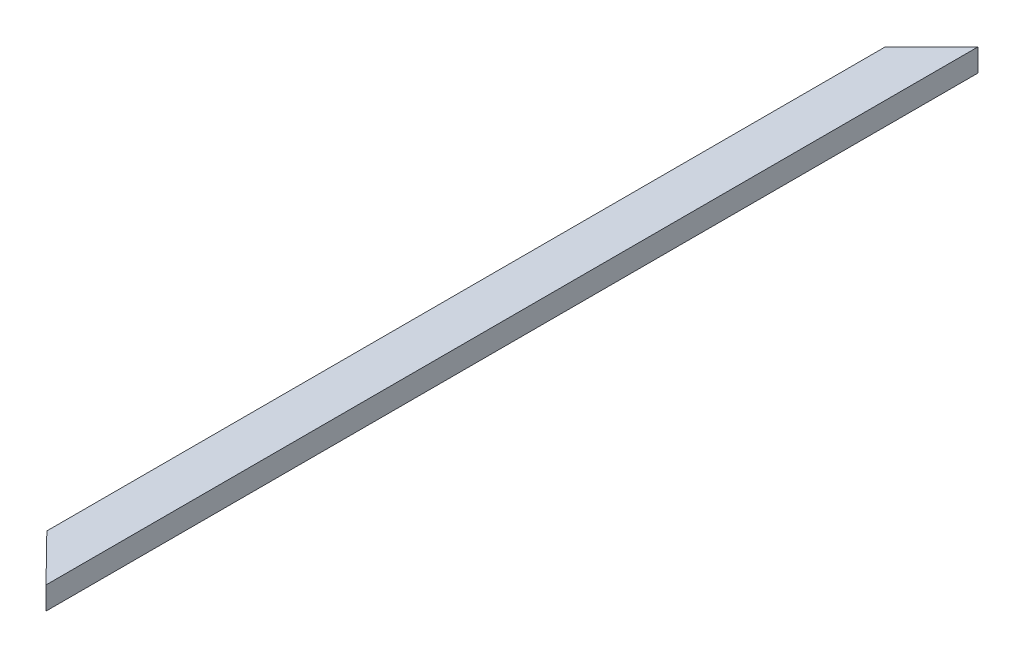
ISO-10303-21;
HEADER;
FILE_DESCRIPTION(('STEP AP214'),'2;1');
FILE_NAME('part.step','',(''),(''),'','','');
FILE_SCHEMA(('AUTOMOTIVE_DESIGN { 1 0 10303 214 1 1 1 1 }'));
ENDSEC;
DATA;
#1=APPLICATION_CONTEXT('core data for automotive mechanical design processes');
#2=APPLICATION_PROTOCOL_DEFINITION('international standard','automotive_design',2000,#1);
#3=PRODUCT_CONTEXT('',#1,'mechanical');
#4=PRODUCT('Part','Part','',(#3));
#5=PRODUCT_RELATED_PRODUCT_CATEGORY('part','',(#4));
#6=PRODUCT_DEFINITION_FORMATION('','',#4);
#7=PRODUCT_DEFINITION_CONTEXT('part definition',#1,'design');
#8=PRODUCT_DEFINITION('design','',#6,#7);
#9=PRODUCT_DEFINITION_SHAPE('','',#8);
#10=(LENGTH_UNIT() NAMED_UNIT(*) SI_UNIT(.MILLI.,.METRE.));
#11=(NAMED_UNIT(*) PLANE_ANGLE_UNIT() SI_UNIT($,.RADIAN.));
#12=(NAMED_UNIT(*) SI_UNIT($,.STERADIAN.) SOLID_ANGLE_UNIT());
#13=UNCERTAINTY_MEASURE_WITH_UNIT(LENGTH_MEASURE(1.E-05),#10,'distance_accuracy_value','');
#14=(GEOMETRIC_REPRESENTATION_CONTEXT(3) GLOBAL_UNCERTAINTY_ASSIGNED_CONTEXT((#13)) GLOBAL_UNIT_ASSIGNED_CONTEXT((#10,
#11,#12)) REPRESENTATION_CONTEXT('',''));
#15=CARTESIAN_POINT('',(0.,0.,0.));
#16=DIRECTION('',(0.,0.,1.));
#17=DIRECTION('',(1.,0.,0.));
#18=AXIS2_PLACEMENT_3D('',#15,#16,#17);
#19=CARTESIAN_POINT('',(23.5,11.5,850.));
#20=DIRECTION('',(-1.,0.,0.));
#21=DIRECTION('',(0.,-1.,0.));
#22=AXIS2_PLACEMENT_3D('',#19,#20,#21);
#23=PLANE('',#22);
#24=DIRECTION('',(0.,0.,-1.));
#25=VECTOR('',#24,1.);
#26=CARTESIAN_POINT('',(23.5,-11.5,850.));
#27=LINE('',#26,#25);
#28=CARTESIAN_POINT('',(23.5,-11.5,897.837723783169));
#29=VERTEX_POINT('',#28);
#30=CARTESIAN_POINT('',(23.5,-11.5,-47.0000000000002));
#31=VERTEX_POINT('',#30);
#32=EDGE_CURVE('E68',#29,#31,#27,.T.);
#33=ORIENTED_EDGE('',*,*,#32,.T.);
#34=DIRECTION('',(0.,-1.,0.));
#35=VECTOR('',#34,1.);
#36=CARTESIAN_POINT('',(23.5,11.5,-47.0000000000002));
#37=LINE('',#36,#35);
#38=CARTESIAN_POINT('',(23.5,11.5,-47.0000000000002));
#39=VERTEX_POINT('',#38);
#40=EDGE_CURVE('E93',#39,#31,#37,.T.);
#41=ORIENTED_EDGE('',*,*,#40,.F.);
#42=DIRECTION('',(0.,0.,-1.));
#43=VECTOR('',#42,1.);
#44=CARTESIAN_POINT('',(23.5,11.5,850.));
#45=LINE('',#44,#43);
#46=CARTESIAN_POINT('',(23.5,11.5,897.837723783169));
#47=VERTEX_POINT('',#46);
#48=EDGE_CURVE('E11',#47,#39,#45,.T.);
#49=ORIENTED_EDGE('',*,*,#48,.F.);
#50=DIRECTION('',(0.,-1.,0.));
#51=VECTOR('',#50,1.);
#52=CARTESIAN_POINT('',(23.5,11.5,897.837723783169));
#53=LINE('',#52,#51);
#54=EDGE_CURVE('E80',#47,#29,#53,.T.);
#55=ORIENTED_EDGE('',*,*,#54,.T.);
#56=EDGE_LOOP('',(#33,#41,#49,#55));
#57=FACE_BOUND('',#56,.T.);
#58=ADVANCED_FACE('F32',(#57),#23,.F.);
#59=CARTESIAN_POINT('',(-23.5,11.5,850.));
#60=DIRECTION('',(0.,-1.,0.));
#61=DIRECTION('',(0.,0.,-1.));
#62=AXIS2_PLACEMENT_3D('',#59,#60,#61);
#63=PLANE('',#62);
#64=ORIENTED_EDGE('',*,*,#48,.T.);
#65=DIRECTION('',(0.707106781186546,0.,-0.707106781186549));
#66=VECTOR('',#65,1.);
#67=CARTESIAN_POINT('',(-23.5,11.5,0.));
#68=LINE('',#67,#66);
#69=CARTESIAN_POINT('',(-23.5,11.5,0.));
#70=VERTEX_POINT('',#69);
#71=EDGE_CURVE('E88',#70,#39,#68,.T.);
#72=ORIENTED_EDGE('',*,*,#71,.F.);
#73=DIRECTION('',(0.,0.,-1.));
#74=VECTOR('',#73,1.);
#75=CARTESIAN_POINT('',(-23.5,11.5,850.));
#76=LINE('',#75,#74);
#77=CARTESIAN_POINT('',(-23.5,11.5,850.));
#78=VERTEX_POINT('',#77);
#79=EDGE_CURVE('E40',#78,#70,#76,.T.);
#80=ORIENTED_EDGE('',*,*,#79,.F.);
#81=DIRECTION('',(0.700833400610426,0.,0.713324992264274));
#82=VECTOR('',#81,1.);
#83=CARTESIAN_POINT('',(-23.5,11.5,850.));
#84=LINE('',#83,#82);
#85=EDGE_CURVE('E84',#78,#47,#84,.T.);
#86=ORIENTED_EDGE('',*,*,#85,.T.);
#87=EDGE_LOOP('',(#64,#72,#80,#86));
#88=FACE_BOUND('',#87,.T.);
#89=ADVANCED_FACE('F104',(#88),#63,.F.);
#90=CARTESIAN_POINT('',(-23.5,11.5,850.));
#91=DIRECTION('',(1.,0.,0.));
#92=DIRECTION('',(0.,1.,0.));
#93=AXIS2_PLACEMENT_3D('',#90,#91,#92);
#94=PLANE('',#93);
#95=DIRECTION('',(0.,-1.,0.));
#96=VECTOR('',#95,1.);
#97=CARTESIAN_POINT('',(-23.5,11.5,0.));
#98=LINE('',#97,#96);
#99=CARTESIAN_POINT('',(-23.5,-11.5,0.));
#100=VERTEX_POINT('',#99);
#101=EDGE_CURVE('E96',#70,#100,#98,.T.);
#102=ORIENTED_EDGE('',*,*,#101,.T.);
#103=DIRECTION('',(0.,0.,-1.));
#104=VECTOR('',#103,1.);
#105=CARTESIAN_POINT('',(-23.5,-11.5,850.));
#106=LINE('',#105,#104);
#107=CARTESIAN_POINT('',(-23.5,-11.5,850.));
#108=VERTEX_POINT('',#107);
#109=EDGE_CURVE('E47',#108,#100,#106,.T.);
#110=ORIENTED_EDGE('',*,*,#109,.F.);
#111=DIRECTION('',(0.,-1.,0.));
#112=VECTOR('',#111,1.);
#113=CARTESIAN_POINT('',(-23.5,11.5,850.));
#114=LINE('',#113,#112);
#115=EDGE_CURVE('E77',#78,#108,#114,.T.);
#116=ORIENTED_EDGE('',*,*,#115,.F.);
#117=ORIENTED_EDGE('',*,*,#79,.T.);
#118=EDGE_LOOP('',(#102,#110,#116,#117));
#119=FACE_BOUND('',#118,.T.);
#120=ADVANCED_FACE('F100',(#119),#94,.F.);
#121=CARTESIAN_POINT('',(-23.5,-11.5,850.));
#122=DIRECTION('',(0.,1.,0.));
#123=DIRECTION('',(0.,0.,1.));
#124=AXIS2_PLACEMENT_3D('',#121,#122,#123);
#125=PLANE('',#124);
#126=ORIENTED_EDGE('',*,*,#109,.T.);
#127=DIRECTION('',(0.707106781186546,0.,-0.707106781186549));
#128=VECTOR('',#127,1.);
#129=CARTESIAN_POINT('',(-23.5,-11.5,0.));
#130=LINE('',#129,#128);
#131=EDGE_CURVE('E73',#100,#31,#130,.T.);
#132=ORIENTED_EDGE('',*,*,#131,.T.);
#133=ORIENTED_EDGE('',*,*,#32,.F.);
#134=DIRECTION('',(0.700833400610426,0.,0.713324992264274));
#135=VECTOR('',#134,1.);
#136=CARTESIAN_POINT('',(-23.5,-11.5,850.));
#137=LINE('',#136,#135);
#138=EDGE_CURVE('E72',#108,#29,#137,.T.);
#139=ORIENTED_EDGE('',*,*,#138,.F.);
#140=EDGE_LOOP('',(#126,#132,#133,#139));
#141=FACE_BOUND('',#140,.T.);
#142=ADVANCED_FACE('F70',(#141),#125,.F.);
#143=CARTESIAN_POINT('',(-23.5,11.5,0.));
#144=DIRECTION('',(-0.707106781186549,0.,-0.707106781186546));
#145=DIRECTION('',(-0.707106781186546,0.,0.707106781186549));
#146=AXIS2_PLACEMENT_3D('',#143,#144,#145);
#147=PLANE('',#146);
#148=ORIENTED_EDGE('',*,*,#131,.F.);
#149=ORIENTED_EDGE('',*,*,#101,.F.);
#150=ORIENTED_EDGE('',*,*,#71,.T.);
#151=ORIENTED_EDGE('',*,*,#40,.T.);
#152=EDGE_LOOP('',(#148,#149,#150,#151));
#153=FACE_BOUND('',#152,.T.);
#154=ADVANCED_FACE('F106',(#153),#147,.T.);
#155=CARTESIAN_POINT('',(-23.5,11.5,850.));
#156=DIRECTION('',(0.713324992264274,0.,-0.700833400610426));
#157=DIRECTION('',(-0.700833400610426,0.,-0.713324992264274));
#158=AXIS2_PLACEMENT_3D('',#155,#156,#157);
#159=PLANE('',#158);
#160=ORIENTED_EDGE('',*,*,#138,.T.);
#161=ORIENTED_EDGE('',*,*,#54,.F.);
#162=ORIENTED_EDGE('',*,*,#85,.F.);
#163=ORIENTED_EDGE('',*,*,#115,.T.);
#164=EDGE_LOOP('',(#160,#161,#162,#163));
#165=FACE_BOUND('',#164,.T.);
#166=ADVANCED_FACE('F86',(#165),#159,.F.);
#167=CLOSED_SHELL('',(#58,#89,#120,#142,#154,#166));
#168=MANIFOLD_SOLID_BREP('B2',#167);
#169=ADVANCED_BREP_SHAPE_REPRESENTATION('',(#18,#168),#14);
#170=SHAPE_DEFINITION_REPRESENTATION(#9,#169);
ENDSEC;
END-ISO-10303-21;
